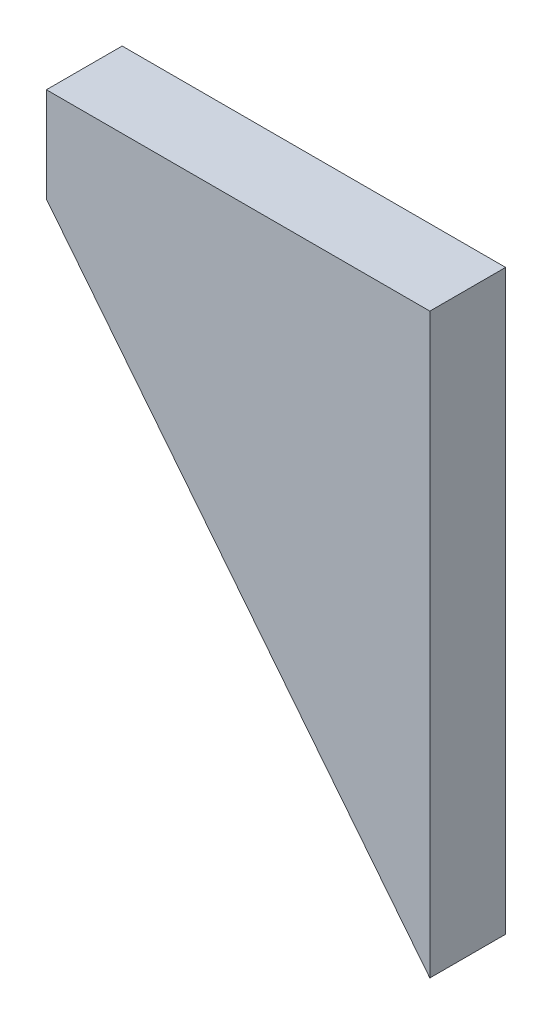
from build123d import *

# Parameters (mm, degrees)
EXTRUSION1_DEPTH = 8


with BuildPart() as part:
    # Esquisse1 → Extrusion1 (new body)
    with BuildSketch(Plane.XY):
        Polygon((0, 0), (0, 10), (40.5, 10), (40.5, -51), align=None)
    extrude(amount=EXTRUSION1_DEPTH)


solid = part.part
